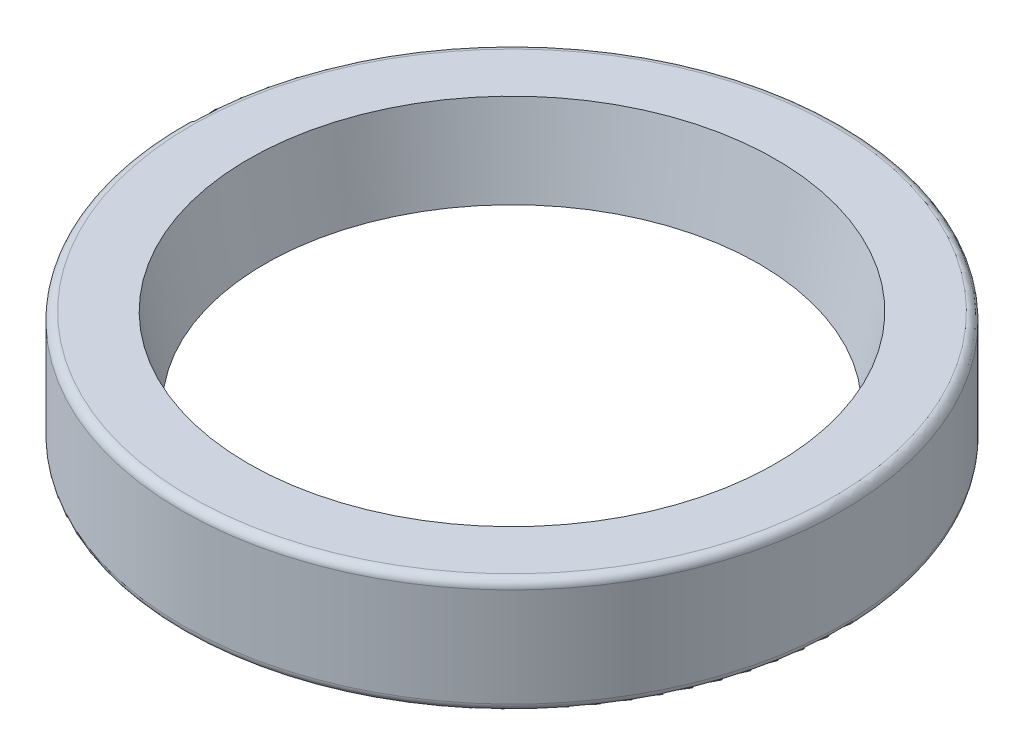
from build123d import *

# Parameters (mm, degrees)
CONG_1_R = 0.5


with BuildPart() as part:
    # Esquisse1 → R_volution1 (revolve)
    with BuildSketch(Plane.XY, mode=Mode.PRIVATE) as r_volution1_sk:
        Polygon((16, 7), (20, 7), (20, 0), (18.5, 0), (18.5, 5.5), (17.5, 5.5), (17.5, 1), (16.644068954, 1), (15, 2), align=None)
    revolve(r_volution1_sk.sketch.rotate(Axis((0, 17.85037642, 0), (0, -1, 0)), 90), axis=Axis((0, 17.85037642, 0), (0, -1, 0)))

    # Cong_1
    cong_1_edges = [part.edges().sort_by_distance(p)[0] for p in [
        (0, 7, -20),
        (0, 0, -20),
    ]]
    fillet(cong_1_edges, radius=CONG_1_R)


solid = part.part
